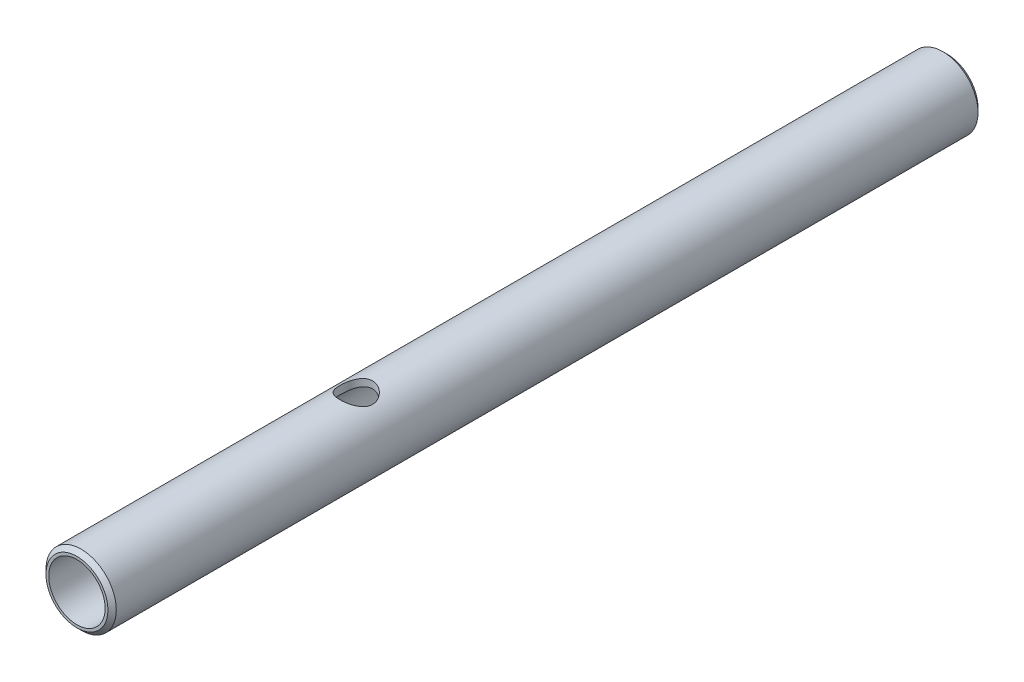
ISO-10303-21;
HEADER;
FILE_DESCRIPTION(('STEP AP214'),'2;1');
FILE_NAME('part.step','',(''),(''),'','','');
FILE_SCHEMA(('AUTOMOTIVE_DESIGN { 1 0 10303 214 1 1 1 1 }'));
ENDSEC;
DATA;
#1=APPLICATION_CONTEXT('core data for automotive mechanical design processes');
#2=APPLICATION_PROTOCOL_DEFINITION('international standard','automotive_design',2000,#1);
#3=PRODUCT_CONTEXT('',#1,'mechanical');
#4=PRODUCT('Part','Part','',(#3));
#5=PRODUCT_RELATED_PRODUCT_CATEGORY('part','',(#4));
#6=PRODUCT_DEFINITION_FORMATION('','',#4);
#7=PRODUCT_DEFINITION_CONTEXT('part definition',#1,'design');
#8=PRODUCT_DEFINITION('design','',#6,#7);
#9=PRODUCT_DEFINITION_SHAPE('','',#8);
#10=(LENGTH_UNIT() NAMED_UNIT(*) SI_UNIT(.MILLI.,.METRE.));
#11=(NAMED_UNIT(*) PLANE_ANGLE_UNIT() SI_UNIT($,.RADIAN.));
#12=(NAMED_UNIT(*) SI_UNIT($,.STERADIAN.) SOLID_ANGLE_UNIT());
#13=UNCERTAINTY_MEASURE_WITH_UNIT(LENGTH_MEASURE(1.E-05),#10,'distance_accuracy_value','');
#14=(GEOMETRIC_REPRESENTATION_CONTEXT(3) GLOBAL_UNCERTAINTY_ASSIGNED_CONTEXT((#13)) GLOBAL_UNIT_ASSIGNED_CONTEXT((#10,
#11,#12)) REPRESENTATION_CONTEXT('',''));
#15=CARTESIAN_POINT('',(0.,0.,0.));
#16=DIRECTION('',(0.,0.,1.));
#17=DIRECTION('',(1.,0.,0.));
#18=AXIS2_PLACEMENT_3D('',#15,#16,#17);
#19=CARTESIAN_POINT('',(0.,0.,302.207660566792));
#20=DIRECTION('',(0.,0.,-1.));
#21=DIRECTION('',(-1.,0.,0.));
#22=AXIS2_PLACEMENT_3D('',#19,#20,#21);
#23=CYLINDRICAL_SURFACE('',#22,10.668);
#24=CARTESIAN_POINT('',(0.,0.,1.26999999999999));
#25=DIRECTION('',(0.,0.,1.));
#26=DIRECTION('',(1.,0.,0.));
#27=AXIS2_PLACEMENT_3D('',#24,#25,#26);
#28=CIRCLE('',#27,10.668);
#29=CARTESIAN_POINT('',(10.668,0.,1.26999999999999));
#30=VERTEX_POINT('',#29);
#31=EDGE_CURVE('E49',#30,#30,#28,.T.);
#32=ORIENTED_EDGE('',*,*,#31,.T.);
#33=EDGE_LOOP('',(#32));
#34=FACE_BOUND('',#33,.T.);
#35=CARTESIAN_POINT('',(0.,0.,262.636));
#36=DIRECTION('',(0.,0.,1.));
#37=DIRECTION('',(1.,0.,0.));
#38=AXIS2_PLACEMENT_3D('',#35,#36,#37);
#39=CIRCLE('',#38,10.668);
#40=CARTESIAN_POINT('',(10.668,0.,262.636));
#41=VERTEX_POINT('',#40);
#42=EDGE_CURVE('E54',#41,#41,#39,.F.);
#43=ORIENTED_EDGE('',*,*,#42,.T.);
#44=EDGE_LOOP('',(#43));
#45=FACE_BOUND('',#44,.T.);
#46=CARTESIAN_POINT('',(0.,10.668,174.239111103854));
#47=CARTESIAN_POINT('',(-0.131525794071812,10.6679992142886,174.239112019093));
#48=CARTESIAN_POINT('',(-0.263076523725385,10.6655614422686,174.244348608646));
#49=CARTESIAN_POINT('',(-0.52522304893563,10.6558709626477,174.265240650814));
#50=CARTESIAN_POINT('',(-0.655818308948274,10.6486157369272,174.280901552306));
#51=CARTESIAN_POINT('',(-0.915247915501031,10.6294632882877,174.322502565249));
#52=CARTESIAN_POINT('',(-1.04407884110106,10.6175580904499,174.348460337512));
#53=CARTESIAN_POINT('',(-1.29887686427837,10.5894090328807,174.410381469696));
#54=CARTESIAN_POINT('',(-1.42484276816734,10.5731633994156,174.446348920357));
#55=CARTESIAN_POINT('',(-1.67251559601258,10.5368168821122,174.527755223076));
#56=CARTESIAN_POINT('',(-1.79423799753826,10.5167322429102,174.573154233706));
#57=CARTESIAN_POINT('',(-2.03325393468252,10.4731510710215,174.673094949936));
#58=CARTESIAN_POINT('',(-2.15054578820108,10.4496532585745,174.727640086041));
#59=CARTESIAN_POINT('',(-2.49462750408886,10.3748716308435,174.90427720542));
#60=CARTESIAN_POINT('',(-2.71392105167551,10.3192539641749,175.039469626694));
#61=CARTESIAN_POINT('',(-3.13903716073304,10.1982490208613,175.349119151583));
#62=CARTESIAN_POINT('',(-3.34347722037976,10.1324947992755,175.525312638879));
#63=CARTESIAN_POINT('',(-3.72124928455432,9.99993017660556,175.908473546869));
#64=CARTESIAN_POINT('',(-3.89456095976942,9.93311911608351,176.115460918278));
#65=CARTESIAN_POINT('',(-4.13313949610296,9.83521502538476,176.452808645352));
#66=CARTESIAN_POINT('',(-4.2110625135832,9.80201411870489,176.573804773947));
#67=CARTESIAN_POINT('',(-4.35635781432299,9.73830842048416,176.822627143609));
#68=CARTESIAN_POINT('',(-4.42373453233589,9.70780249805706,176.95045048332));
#69=CARTESIAN_POINT('',(-4.54734281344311,9.65052044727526,177.212176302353));
#70=CARTESIAN_POINT('',(-4.60357463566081,9.62374423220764,177.346078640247));
#71=CARTESIAN_POINT('',(-4.70427323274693,9.57492405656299,177.619002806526));
#72=CARTESIAN_POINT('',(-4.74874655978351,9.55287746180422,177.75802173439));
#73=CARTESIAN_POINT('',(-4.82329219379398,9.51544641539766,178.03239045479));
#74=CARTESIAN_POINT('',(-4.85402305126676,9.49976177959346,178.167520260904));
#75=CARTESIAN_POINT('',(-4.90411008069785,9.47400257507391,178.440339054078));
#76=CARTESIAN_POINT('',(-4.9234719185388,9.46392521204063,178.578026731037));
#77=CARTESIAN_POINT('',(-4.9505648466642,9.44978129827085,178.854791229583));
#78=CARTESIAN_POINT('',(-4.95830093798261,9.44571216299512,178.993867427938));
#79=CARTESIAN_POINT('',(-4.96204246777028,9.44374740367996,179.272216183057));
#80=CARTESIAN_POINT('',(-4.95804877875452,9.44585132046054,179.411488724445));
#81=CARTESIAN_POINT('',(-4.93938118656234,9.45562425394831,179.67505167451));
#82=CARTESIAN_POINT('',(-4.92581818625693,9.46271418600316,179.799444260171));
#83=CARTESIAN_POINT('',(-4.88940346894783,9.48158099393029,180.046540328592));
#84=CARTESIAN_POINT('',(-4.86654877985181,9.49335936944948,180.169243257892));
#85=CARTESIAN_POINT('',(-4.81179972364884,9.52122624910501,180.412092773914));
#86=CARTESIAN_POINT('',(-4.7799069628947,9.53731398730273,180.532239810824));
#87=CARTESIAN_POINT('',(-4.70739727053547,9.57331013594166,180.769301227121));
#88=CARTESIAN_POINT('',(-4.66677694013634,9.5932200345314,180.886214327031));
#89=CARTESIAN_POINT('',(-4.53030296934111,9.65882811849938,181.236316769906));
#90=CARTESIAN_POINT('',(-4.42105943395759,9.70974869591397,181.463470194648));
#91=CARTESIAN_POINT('',(-4.17069597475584,9.81988609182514,181.89711509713));
#92=CARTESIAN_POINT('',(-4.02956215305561,9.87910652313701,182.103597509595));
#93=CARTESIAN_POINT('',(-3.70164512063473,10.0069099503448,182.513593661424));
#94=CARTESIAN_POINT('',(-3.51158235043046,10.0758143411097,182.714392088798));
#95=CARTESIAN_POINT('',(-3.09985101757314,10.2099896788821,183.082363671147));
#96=CARTESIAN_POINT('',(-2.87817109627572,10.2752593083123,183.249524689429));
#97=CARTESIAN_POINT('',(-2.52161198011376,10.3664634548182,183.47406777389));
#98=CARTESIAN_POINT('',(-2.39637237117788,10.3961982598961,183.545537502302));
#99=CARTESIAN_POINT('',(-2.13952199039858,10.4520764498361,183.677567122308));
#100=CARTESIAN_POINT('',(-2.00791389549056,10.4782213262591,183.738131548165));
#101=CARTESIAN_POINT('',(-1.73926283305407,10.5261487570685,183.847715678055));
#102=CARTESIAN_POINT('',(-1.60222167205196,10.5479327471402,183.896739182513));
#103=CARTESIAN_POINT('',(-1.32371225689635,10.5864895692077,183.982697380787));
#104=CARTESIAN_POINT('',(-1.18224443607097,10.6032628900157,184.019633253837));
#105=CARTESIAN_POINT('',(-0.90678938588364,10.630223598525,184.078646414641));
#106=CARTESIAN_POINT('',(-0.773034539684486,10.6408098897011,184.101628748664));
#107=CARTESIAN_POINT('',(-0.503794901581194,10.6569506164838,184.136568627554));
#108=CARTESIAN_POINT('',(-0.368310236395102,10.6625054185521,184.14852697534));
#109=CARTESIAN_POINT('',(-0.0967464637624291,10.6684256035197,184.161269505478));
#110=CARTESIAN_POINT('',(0.0393324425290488,10.6687926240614,184.1620572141));
#111=CARTESIAN_POINT('',(0.311007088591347,10.6643308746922,184.152457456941));
#112=CARTESIAN_POINT('',(0.446602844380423,10.6595022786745,184.14207036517));
#113=CARTESIAN_POINT('',(0.707414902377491,10.645267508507,184.111290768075));
#114=CARTESIAN_POINT('',(0.832731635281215,10.6361802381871,184.091594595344));
#115=CARTESIAN_POINT('',(1.08116702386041,10.6138053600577,184.042753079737));
#116=CARTESIAN_POINT('',(1.20428496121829,10.600516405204,184.013604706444));
#117=CARTESIAN_POINT('',(1.44745745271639,10.5700565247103,183.946153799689));
#118=CARTESIAN_POINT('',(1.56751290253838,10.5528867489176,183.907853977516));
#119=CARTESIAN_POINT('',(1.80390035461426,10.5150620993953,183.822448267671));
#120=CARTESIAN_POINT('',(1.92023091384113,10.4944058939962,183.775339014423));
#121=CARTESIAN_POINT('',(2.26955792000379,10.4265301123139,183.618241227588));
#122=CARTESIAN_POINT('',(2.49559305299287,10.3743518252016,183.494509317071));
#123=CARTESIAN_POINT('',(2.92437804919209,10.2617526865,183.214881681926));
#124=CARTESIAN_POINT('',(3.12711761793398,10.2013282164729,183.058971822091));
#125=CARTESIAN_POINT('',(3.52239327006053,10.0720335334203,182.703608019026));
#126=CARTESIAN_POINT('',(3.71249446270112,10.0028864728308,182.501541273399));
#127=CARTESIAN_POINT('',(4.05706799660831,9.86816773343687,182.067596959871));
#128=CARTESIAN_POINT('',(4.21152367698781,9.80259773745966,181.835705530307));
#129=CARTESIAN_POINT('',(4.4152582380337,9.71171954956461,181.46556301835));
#130=CARTESIAN_POINT('',(4.47928245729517,9.68227332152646,181.336247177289));
#131=CARTESIAN_POINT('',(4.59606935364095,9.62738450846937,181.071829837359));
#132=CARTESIAN_POINT('',(4.64883707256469,9.60194013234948,180.936730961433));
#133=CARTESIAN_POINT('',(4.74250007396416,9.55602642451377,180.661760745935));
#134=CARTESIAN_POINT('',(4.7834033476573,9.53555374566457,180.521892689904));
#135=CARTESIAN_POINT('',(4.85285311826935,9.50039795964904,180.238409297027));
#136=CARTESIAN_POINT('',(4.8814011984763,9.48571411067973,180.094794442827));
#137=CARTESIAN_POINT('',(4.92373259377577,9.46380442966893,179.81811636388));
#138=CARTESIAN_POINT('',(4.93861146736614,9.45602733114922,179.685263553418));
#139=CARTESIAN_POINT('',(4.95759204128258,9.44609033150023,179.418584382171));
#140=CARTESIAN_POINT('',(4.96169457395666,9.44392999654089,179.284758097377));
#141=CARTESIAN_POINT('',(4.95906701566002,9.44530994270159,179.017274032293));
#142=CARTESIAN_POINT('',(4.95233942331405,9.44884890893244,178.883616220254));
#143=CARTESIAN_POINT('',(4.92814953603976,9.46148778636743,178.61754700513));
#144=CARTESIAN_POINT('',(4.9106874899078,9.47058756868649,178.48513557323));
#145=CARTESIAN_POINT('',(4.86689735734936,9.49316033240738,178.23208692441));
#146=CARTESIAN_POINT('',(4.84130059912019,9.50627004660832,178.111289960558));
#147=CARTESIAN_POINT('',(4.78133269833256,9.53657176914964,177.872404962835));
#148=CARTESIAN_POINT('',(4.74695878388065,9.55376506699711,177.754317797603));
#149=CARTESIAN_POINT('',(4.63113628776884,9.61073703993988,177.405196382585));
#150=CARTESIAN_POINT('',(4.53695752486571,9.65592382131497,177.179134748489));
#151=CARTESIAN_POINT('',(4.31034895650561,9.75927937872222,176.730734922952));
#152=CARTESIAN_POINT('',(4.17580188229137,9.81810893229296,176.509631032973));
#153=CARTESIAN_POINT('',(3.87488230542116,9.94072150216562,176.091772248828));
#154=CARTESIAN_POINT('',(3.70849505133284,10.0045068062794,175.895028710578));
#155=CARTESIAN_POINT('',(3.32897005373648,10.1374719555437,175.511171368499));
#156=CARTESIAN_POINT('',(3.11282993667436,10.2065581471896,175.32695630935));
#157=CARTESIAN_POINT('',(2.76636079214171,10.3037846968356,175.079630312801));
#158=CARTESIAN_POINT('',(2.64705387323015,10.33514959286,175.001969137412));
#159=CARTESIAN_POINT('',(2.40166723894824,10.3949085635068,174.856918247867));
#160=CARTESIAN_POINT('',(2.27559068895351,10.4233040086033,174.789523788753));
#161=CARTESIAN_POINT('',(2.01812521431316,10.4761912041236,174.665945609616));
#162=CARTESIAN_POINT('',(1.88676790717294,10.5007028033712,174.609704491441));
#163=CARTESIAN_POINT('',(1.61908071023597,10.5452925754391,174.508592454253));
#164=CARTESIAN_POINT('',(1.48275327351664,10.565372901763,174.463716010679));
#165=CARTESIAN_POINT('',(1.2064420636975,10.6004751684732,174.385917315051));
#166=CARTESIAN_POINT('',(1.06646759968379,10.6155088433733,174.35296731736));
#167=CARTESIAN_POINT('',(0.783788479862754,10.6401127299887,174.299312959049));
#168=CARTESIAN_POINT('',(0.641085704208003,10.6496865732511,174.278600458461));
#169=CARTESIAN_POINT('',(0.415044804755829,10.6602446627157,174.255806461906));
#170=CARTESIAN_POINT('',(0.332192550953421,10.6631497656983,174.249548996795));
#171=CARTESIAN_POINT('',(0.166230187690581,10.6670277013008,174.241200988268));
#172=CARTESIAN_POINT('',(0.0831200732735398,10.6680004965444,174.239110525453));
#173=CARTESIAN_POINT('',(0.,10.668,174.239111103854));
#174=B_SPLINE_CURVE_WITH_KNOTS('',3,(#46,#47,#48,#49,#50,#51,#52,#53,#54,#55,#56,#57,#58,#59,
#60,#61,#62,#63,#64,#65,#66,#67,#68,#69,#70,#71,#72,#73,#74,#75,#76,#77,#78,#79,#80,#81,#82,#83,
#84,#85,#86,#87,#88,#89,#90,#91,#92,#93,#94,#95,#96,#97,#98,#99,#100,#101,#102,#103,#104,#105,
#106,#107,#108,#109,#110,#111,#112,#113,#114,#115,#116,#117,#118,#119,#120,#121,#122,#123,#124,
#125,#126,#127,#128,#129,#130,#131,#132,#133,#134,#135,#136,#137,#138,#139,#140,#141,#142,#143,
#144,#145,#146,#147,#148,#149,#150,#151,#152,#153,#154,#155,#156,#157,#158,#159,#160,#161,#162,
#163,#164,#165,#166,#167,#168,#169,#170,#171,#172,#173),.UNSPECIFIED.,.T.,.F.,(4,2,2,2,2,2,2,2,
2,2,2,2,2,2,2,2,2,2,2,2,2,2,2,2,2,2,2,2,2,2,2,2,2,2,2,2,2,2,2,2,2,2,2,2,2,2,2,2,2,2,2,2,2,2,2,2,
2,2,2,2,2,2,2,4),(0.,0.394494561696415,0.78919549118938,1.18457634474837,1.58011901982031,
1.97402360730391,2.36807627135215,3.15524220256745,3.98524496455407,4.81578782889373,
5.25841469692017,5.70085493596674,6.14328488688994,6.58546778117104,7.00328287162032,
7.42088956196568,7.83831655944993,8.25571250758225,8.63126180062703,9.00693131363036,
9.38253410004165,9.7582834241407,10.5263165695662,11.2946850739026,12.1458155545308,
12.9972525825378,13.4384582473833,13.8794800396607,14.3203563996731,14.7611897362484,
15.1690354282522,15.5768514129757,15.984538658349,16.3922122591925,16.7733118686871,
17.1545337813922,17.5356428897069,17.9168978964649,18.7020429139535,19.4875335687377,
20.3415801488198,21.1960251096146,21.6373422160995,22.0784612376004,22.5192824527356,
22.9600471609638,23.3612359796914,23.7623938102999,24.1634591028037,24.5645151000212,
24.9366087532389,25.3088200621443,26.0527361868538,26.8458355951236,27.6393033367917,
28.5116035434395,28.948473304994,29.3851405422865,29.8194986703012,30.2536452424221,
30.6867752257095,31.1196167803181,31.3689198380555,31.6182277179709),.UNSPECIFIED.);
#175=CARTESIAN_POINT('',(0.,10.668,174.239111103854));
#176=VERTEX_POINT('',#175);
#177=EDGE_CURVE('E61',#176,#176,#174,.T.);
#178=ORIENTED_EDGE('',*,*,#177,.F.);
#179=EDGE_LOOP('',(#178));
#180=FACE_BOUND('',#179,.T.);
#181=ADVANCED_FACE('F33',(#34,#45,#180),#23,.T.);
#182=CARTESIAN_POINT('',(0.,0.,302.207660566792));
#183=DIRECTION('',(0.,0.,-1.));
#184=DIRECTION('',(-1.,0.,0.));
#185=AXIS2_PLACEMENT_3D('',#182,#183,#184);
#186=CYLINDRICAL_SURFACE('',#185,8.5598);
#187=CARTESIAN_POINT('',(0.,0.,263.906));
#188=DIRECTION('',(0.,0.,1.));
#189=DIRECTION('',(1.,0.,0.));
#190=AXIS2_PLACEMENT_3D('',#187,#188,#189);
#191=CIRCLE('',#190,8.5598);
#192=CARTESIAN_POINT('',(8.5598,0.,263.906));
#193=VERTEX_POINT('',#192);
#194=EDGE_CURVE('E58',#193,#193,#191,.T.);
#195=ORIENTED_EDGE('',*,*,#194,.T.);
#196=EDGE_LOOP('',(#195));
#197=FACE_BOUND('',#196,.T.);
#198=CARTESIAN_POINT('',(0.,0.,0.));
#199=DIRECTION('',(0.,0.,1.));
#200=DIRECTION('',(1.,0.,0.));
#201=AXIS2_PLACEMENT_3D('',#198,#199,#200);
#202=CIRCLE('',#201,8.5598);
#203=CARTESIAN_POINT('',(8.5598,0.,0.));
#204=VERTEX_POINT('',#203);
#205=EDGE_CURVE('E57',#204,#204,#202,.T.);
#206=ORIENTED_EDGE('',*,*,#205,.F.);
#207=EDGE_LOOP('',(#206));
#208=FACE_BOUND('',#207,.T.);
#209=CARTESIAN_POINT('',(0.,8.5598,174.239111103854));
#210=CARTESIAN_POINT('',(-0.127684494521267,8.55979898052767,174.239112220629));
#211=CARTESIAN_POINT('',(-0.255399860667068,8.55693576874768,174.24404841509));
#212=CARTESIAN_POINT('',(-0.509872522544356,8.54555125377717,174.2637323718));
#213=CARTESIAN_POINT('',(-0.636629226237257,8.53702670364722,174.278485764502));
#214=CARTESIAN_POINT('',(-0.888390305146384,8.51451339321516,174.317644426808));
#215=CARTESIAN_POINT('',(-1.01339103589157,8.50051462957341,174.342067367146));
#216=CARTESIAN_POINT('',(-1.26055009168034,8.46739319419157,174.400263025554));
#217=CARTESIAN_POINT('',(-1.38270718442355,8.44826834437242,174.434039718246));
#218=CARTESIAN_POINT('',(-1.62270939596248,8.40546049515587,174.510345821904));
#219=CARTESIAN_POINT('',(-1.7405737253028,8.3818018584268,174.552828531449));
#220=CARTESIAN_POINT('',(-1.97201273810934,8.33039147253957,174.646214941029));
#221=CARTESIAN_POINT('',(-2.08558577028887,8.30263816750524,174.697121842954));
#222=CARTESIAN_POINT('',(-2.41882433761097,8.21414225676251,174.861722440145));
#223=CARTESIAN_POINT('',(-2.63130797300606,8.14810814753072,174.987392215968));
#224=CARTESIAN_POINT('',(-3.04808770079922,8.00198250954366,175.277218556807));
#225=CARTESIAN_POINT('',(-3.25063591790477,7.92121469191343,175.443524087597));
#226=CARTESIAN_POINT('',(-3.62669242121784,7.756255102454,175.805178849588));
#227=CARTESIAN_POINT('',(-3.80016548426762,7.67205932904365,176.000562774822));
#228=CARTESIAN_POINT('',(-4.13285500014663,7.49857950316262,176.440790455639));
#229=CARTESIAN_POINT('',(-4.28826948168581,7.40978929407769,176.688725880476));
#230=CARTESIAN_POINT('',(-4.55457627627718,7.24915959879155,177.212394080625));
#231=CARTESIAN_POINT('',(-4.66553738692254,7.17729399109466,177.488083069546));
#232=CARTESIAN_POINT('',(-4.81775575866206,7.07571922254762,177.995433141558));
#233=CARTESIAN_POINT('',(-4.86911736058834,7.04014406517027,178.222885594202));
#234=CARTESIAN_POINT('',(-4.939357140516,6.99105445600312,178.684989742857));
#235=CARTESIAN_POINT('',(-4.95827165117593,6.9775153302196,178.919633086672));
#236=CARTESIAN_POINT('',(-4.96255931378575,6.97446722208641,179.389738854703));
#237=CARTESIAN_POINT('',(-4.94788149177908,6.98499475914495,179.625201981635));
#238=CARTESIAN_POINT('',(-4.88576917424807,7.02857076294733,180.089675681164));
#239=CARTESIAN_POINT('',(-4.83831153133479,7.06163514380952,180.318681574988));
#240=CARTESIAN_POINT('',(-4.71342878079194,7.14558000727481,180.763179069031));
#241=CARTESIAN_POINT('',(-4.63619128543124,7.19634876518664,180.978745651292));
#242=CARTESIAN_POINT('',(-4.45446232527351,7.31022633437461,181.39450821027));
#243=CARTESIAN_POINT('',(-4.34996055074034,7.37333981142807,181.594698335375));
#244=CARTESIAN_POINT('',(-4.09685628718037,7.51734426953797,182.008960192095));
#245=CARTESIAN_POINT('',(-3.94382763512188,7.5994519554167,182.219901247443));
#246=CARTESIAN_POINT('',(-3.6068532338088,7.76505007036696,182.615259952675));
#247=CARTESIAN_POINT('',(-3.42288017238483,7.84854166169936,182.799653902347));
#248=CARTESIAN_POINT('',(-3.11399776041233,7.97418386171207,183.063941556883));
#249=CARTESIAN_POINT('',(-2.99861489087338,8.01839258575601,183.154174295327));
#250=CARTESIAN_POINT('',(-2.75957688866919,8.10376395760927,183.324534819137));
#251=CARTESIAN_POINT('',(-2.63592484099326,8.14492772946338,183.404666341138));
#252=CARTESIAN_POINT('',(-2.38100736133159,8.22306223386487,183.554082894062));
#253=CARTESIAN_POINT('',(-2.24974351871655,8.26003383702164,183.623370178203));
#254=CARTESIAN_POINT('',(-1.98039331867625,8.32871676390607,183.750329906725));
#255=CARTESIAN_POINT('',(-1.84230781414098,8.36042874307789,183.808003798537));
#256=CARTESIAN_POINT('',(-1.5698820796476,8.41567803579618,183.907469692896));
#257=CARTESIAN_POINT('',(-1.43592073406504,8.4396233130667,183.950072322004));
#258=CARTESIAN_POINT('',(-1.16397880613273,8.48140580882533,184.023914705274));
#259=CARTESIAN_POINT('',(-1.02599881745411,8.49924392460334,184.055156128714));
#260=CARTESIAN_POINT('',(-0.747302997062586,8.52826631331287,184.105781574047));
#261=CARTESIAN_POINT('',(-0.606589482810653,8.53945598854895,184.125175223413));
#262=CARTESIAN_POINT('',(-0.323643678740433,8.55485214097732,184.151820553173));
#263=CARTESIAN_POINT('',(-0.181411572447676,8.55905945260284,184.15907368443));
#264=CARTESIAN_POINT('',(0.0852736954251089,8.56027985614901,184.16117873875));
#265=CARTESIAN_POINT('',(0.209714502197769,8.55813072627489,184.157474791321));
#266=CARTESIAN_POINT('',(0.457796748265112,8.54845084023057,184.140746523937));
#267=CARTESIAN_POINT('',(0.581437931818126,8.54091844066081,184.127719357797));
#268=CARTESIAN_POINT('',(0.826929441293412,8.52065257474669,184.092511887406));
#269=CARTESIAN_POINT('',(0.948780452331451,8.50792115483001,184.070335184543));
#270=CARTESIAN_POINT('',(1.18992249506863,8.47756246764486,184.017106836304));
#271=CARTESIAN_POINT('',(1.30921252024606,8.45993331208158,183.986051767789));
#272=CARTESIAN_POINT('',(1.65868449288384,8.40083517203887,183.881075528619));
#273=CARTESIAN_POINT('',(1.88419244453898,8.35282875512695,183.794793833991));
#274=CARTESIAN_POINT('',(2.31749822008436,8.24314966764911,183.592259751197));
#275=CARTESIAN_POINT('',(2.52529199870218,8.18147388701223,183.476000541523));
#276=CARTESIAN_POINT('',(2.94080503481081,8.04205676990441,183.203158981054));
#277=CARTESIAN_POINT('',(3.14625676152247,7.96331078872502,183.04363591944));
#278=CARTESIAN_POINT('',(3.52905751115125,7.8012343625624,182.695525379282));
#279=CARTESIAN_POINT('',(3.70637349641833,7.71789868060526,182.50690423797));
#280=CARTESIAN_POINT('',(4.04908018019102,7.54427940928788,182.080034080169));
#281=CARTESIAN_POINT('',(4.21064949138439,7.45432342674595,181.838560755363));
#282=CARTESIAN_POINT('',(4.49065731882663,7.28908064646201,181.327269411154));
#283=CARTESIAN_POINT('',(4.60915048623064,7.21377531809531,181.057487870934));
#284=CARTESIAN_POINT('',(4.77726188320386,7.10322607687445,180.556056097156));
#285=CARTESIAN_POINT('',(4.83620961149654,7.06285049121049,180.328672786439));
#286=CARTESIAN_POINT('',(4.92140417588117,7.00376520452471,179.865218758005));
#287=CARTESIAN_POINT('',(4.94769056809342,6.98502929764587,179.629158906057));
#288=CARTESIAN_POINT('',(4.96611066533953,6.97194922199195,179.154423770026));
#289=CARTESIAN_POINT('',(4.95816041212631,6.97766501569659,178.915743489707));
#290=CARTESIAN_POINT('',(4.90841392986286,7.01273936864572,178.443663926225));
#291=CARTESIAN_POINT('',(4.86659672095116,7.0421125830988,178.210268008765));
#292=CARTESIAN_POINT('',(4.75285865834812,7.11934179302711,177.760797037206));
#293=CARTESIAN_POINT('',(4.68172875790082,7.16670978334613,177.544432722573));
#294=CARTESIAN_POINT('',(4.51214995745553,7.27466474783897,177.126276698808));
#295=CARTESIAN_POINT('',(4.41369122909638,7.33525647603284,176.924490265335));
#296=CARTESIAN_POINT('',(4.17471086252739,7.47421485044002,176.507925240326));
#297=CARTESIAN_POINT('',(4.0300378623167,7.55388114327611,176.295968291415));
#298=CARTESIAN_POINT('',(3.71029050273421,7.71595909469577,175.897181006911));
#299=CARTESIAN_POINT('',(3.53518848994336,7.79837319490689,175.710373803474));
#300=CARTESIAN_POINT('',(3.23904513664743,7.92416585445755,175.439747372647));
#301=CARTESIAN_POINT('',(3.1272985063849,7.9690370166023,175.346282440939));
#302=CARTESIAN_POINT('',(2.8953839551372,8.05619309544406,175.16912629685));
#303=CARTESIAN_POINT('',(2.77521901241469,8.09847891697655,175.085431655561));
#304=CARTESIAN_POINT('',(2.52706260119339,8.17931312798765,174.928518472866));
#305=CARTESIAN_POINT('',(2.39907199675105,8.21786192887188,174.85529877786));
#306=CARTESIAN_POINT('',(2.13600124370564,8.29013052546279,174.720098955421));
#307=CARTESIAN_POINT('',(2.0009230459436,8.32385164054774,174.658115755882));
#308=CARTESIAN_POINT('',(1.74927695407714,8.37996044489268,174.556156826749));
#309=CARTESIAN_POINT('',(1.63370815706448,8.40329673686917,174.514227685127));
#310=CARTESIAN_POINT('',(1.39904419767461,8.44553459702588,174.438890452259));
#311=CARTESIAN_POINT('',(1.27994966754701,8.46443695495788,174.405480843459));
#312=CARTESIAN_POINT('',(1.03924316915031,8.49734505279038,174.347616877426));
#313=CARTESIAN_POINT('',(0.91763780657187,8.51136224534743,174.32314156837));
#314=CARTESIAN_POINT('',(0.672504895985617,8.53422810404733,174.28334104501));
#315=CARTESIAN_POINT('',(0.548978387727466,8.54307947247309,174.268011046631));
#316=CARTESIAN_POINT('',(0.354350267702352,8.552754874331,174.251275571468));
#317=CARTESIAN_POINT('',(0.283592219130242,8.55539439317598,174.246716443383));
#318=CARTESIAN_POINT('',(0.141892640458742,8.55891736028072,174.240633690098));
#319=CARTESIAN_POINT('',(0.0709510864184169,8.55980056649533,174.23911048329));
#320=CARTESIAN_POINT('',(0.,8.5598,174.239111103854));
#321=B_SPLINE_CURVE_WITH_KNOTS('',3,(#209,#210,#211,#212,#213,#214,#215,#216,#217,#218,#219,
#220,#221,#222,#223,#224,#225,#226,#227,#228,#229,#230,#231,#232,#233,#234,#235,#236,#237,#238,
#239,#240,#241,#242,#243,#244,#245,#246,#247,#248,#249,#250,#251,#252,#253,#254,#255,#256,#257,
#258,#259,#260,#261,#262,#263,#264,#265,#266,#267,#268,#269,#270,#271,#272,#273,#274,#275,#276,
#277,#278,#279,#280,#281,#282,#283,#284,#285,#286,#287,#288,#289,#290,#291,#292,#293,#294,#295,
#296,#297,#298,#299,#300,#301,#302,#303,#304,#305,#306,#307,#308,#309,#310,#311,#312,#313,#314,
#315,#316,#317,#318,#319,#320),.UNSPECIFIED.,.T.,.F.,(4,2,2,2,2,2,2,2,2,2,2,2,2,2,2,2,2,2,2,2,2,
2,2,2,2,2,2,2,2,2,2,2,2,2,2,2,2,2,2,2,2,2,2,2,2,2,2,2,2,2,2,2,2,2,2,4),(0.,0.382980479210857,
0.766180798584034,1.15008465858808,1.53415189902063,1.91621043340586,2.29841451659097,
3.06187762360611,3.88142042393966,4.7019489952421,5.61482681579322,6.52628632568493,
7.23087837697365,7.9346809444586,8.63955218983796,9.34492168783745,10.0459181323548,
10.7471800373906,11.5637591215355,12.3810627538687,12.839570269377,13.2979076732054,
13.7561497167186,14.2143346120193,14.641514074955,15.0686307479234,15.4953998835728,
15.9221180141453,16.2952016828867,16.6683992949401,17.0414501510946,17.4146450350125,
18.1498364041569,18.885195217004,19.6972396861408,20.5102307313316,21.4183242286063,
22.3252615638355,23.0372714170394,23.7484181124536,24.461309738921,25.1746433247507,
25.869872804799,26.5653526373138,27.3684563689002,28.1722938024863,28.6291159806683,
29.0857773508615,29.5423883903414,29.998874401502,30.3738885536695,30.7488358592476,
31.1228981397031,31.4967645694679,31.7095479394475,31.9223606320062),.UNSPECIFIED.);
#322=CARTESIAN_POINT('',(0.,8.5598,174.239111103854));
#323=VERTEX_POINT('',#322);
#324=EDGE_CURVE('E37',#323,#323,#321,.T.);
#325=ORIENTED_EDGE('',*,*,#324,.T.);
#326=EDGE_LOOP('',(#325));
#327=FACE_BOUND('',#326,.T.);
#328=ADVANCED_FACE('F80',(#197,#208,#327),#186,.F.);
#329=CARTESIAN_POINT('',(0.,0.,0.));
#330=DIRECTION('',(0.,0.,1.));
#331=DIRECTION('',(1.,0.,0.));
#332=AXIS2_PLACEMENT_3D('',#329,#330,#331);
#333=PLANE('',#332);
#334=CARTESIAN_POINT('',(0.,0.,0.));
#335=DIRECTION('',(0.,0.,1.));
#336=DIRECTION('',(1.,0.,0.));
#337=AXIS2_PLACEMENT_3D('',#334,#335,#336);
#338=CIRCLE('',#337,9.39799999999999);
#339=CARTESIAN_POINT('',(9.39799999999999,0.,0.));
#340=VERTEX_POINT('',#339);
#341=EDGE_CURVE('E45',#340,#340,#338,.F.);
#342=ORIENTED_EDGE('',*,*,#341,.T.);
#343=EDGE_LOOP('',(#342));
#344=FACE_BOUND('',#343,.T.);
#345=ORIENTED_EDGE('',*,*,#205,.T.);
#346=EDGE_LOOP('',(#345));
#347=FACE_BOUND('',#346,.T.);
#348=ADVANCED_FACE('F79',(#344,#347),#333,.F.);
#349=CARTESIAN_POINT('',(0.,24.13,263.906));
#350=DIRECTION('',(0.,0.,1.));
#351=DIRECTION('',(1.,0.,0.));
#352=AXIS2_PLACEMENT_3D('',#349,#350,#351);
#353=PLANE('',#352);
#354=CARTESIAN_POINT('',(0.,0.,263.906));
#355=DIRECTION('',(0.,0.,1.));
#356=DIRECTION('',(1.,0.,0.));
#357=AXIS2_PLACEMENT_3D('',#354,#355,#356);
#358=CIRCLE('',#357,9.39799999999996);
#359=CARTESIAN_POINT('',(9.39799999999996,0.,263.906));
#360=VERTEX_POINT('',#359);
#361=EDGE_CURVE('E11',#360,#360,#358,.T.);
#362=ORIENTED_EDGE('',*,*,#361,.T.);
#363=EDGE_LOOP('',(#362));
#364=FACE_BOUND('',#363,.T.);
#365=ORIENTED_EDGE('',*,*,#194,.F.);
#366=EDGE_LOOP('',(#365));
#367=FACE_BOUND('',#366,.T.);
#368=ADVANCED_FACE('F75',(#364,#367),#353,.T.);
#369=CARTESIAN_POINT('',(0.,0.,1.26999999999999));
#370=DIRECTION('',(0.,0.,1.));
#371=DIRECTION('',(1.,0.,0.));
#372=AXIS2_PLACEMENT_3D('',#369,#370,#371);
#373=CONICAL_SURFACE('',#372,10.668,0.785398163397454);
#374=ORIENTED_EDGE('',*,*,#341,.F.);
#375=EDGE_LOOP('',(#374));
#376=FACE_BOUND('',#375,.T.);
#377=ORIENTED_EDGE('',*,*,#31,.F.);
#378=EDGE_LOOP('',(#377));
#379=FACE_BOUND('',#378,.T.);
#380=ADVANCED_FACE('F78',(#376,#379),#373,.T.);
#381=CARTESIAN_POINT('',(0.,0.,263.906));
#382=DIRECTION('',(0.,0.,-1.));
#383=DIRECTION('',(-1.,0.,0.));
#384=AXIS2_PLACEMENT_3D('',#381,#382,#383);
#385=CONICAL_SURFACE('',#384,9.39799999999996,0.785398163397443);
#386=ORIENTED_EDGE('',*,*,#42,.F.);
#387=EDGE_LOOP('',(#386));
#388=FACE_BOUND('',#387,.T.);
#389=ORIENTED_EDGE('',*,*,#361,.F.);
#390=EDGE_LOOP('',(#389));
#391=FACE_BOUND('',#390,.T.);
#392=ADVANCED_FACE('F35',(#388,#391),#385,.T.);
#393=CARTESIAN_POINT('',(0.,10.668,179.199731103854));
#394=DIRECTION('',(0.,-1.,0.));
#395=DIRECTION('',(0.,0.,-1.));
#396=AXIS2_PLACEMENT_3D('',#393,#394,#395);
#397=CYLINDRICAL_SURFACE('',#396,4.96061999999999);
#398=ORIENTED_EDGE('',*,*,#324,.F.);
#399=EDGE_LOOP('',(#398));
#400=FACE_BOUND('',#399,.T.);
#401=ORIENTED_EDGE('',*,*,#177,.T.);
#402=EDGE_LOOP('',(#401));
#403=FACE_BOUND('',#402,.T.);
#404=ADVANCED_FACE('F70',(#400,#403),#397,.F.);
#405=CLOSED_SHELL('',(#181,#328,#348,#368,#380,#392,#404));
#406=MANIFOLD_SOLID_BREP('B2',#405);
#407=ADVANCED_BREP_SHAPE_REPRESENTATION('',(#18,#406),#14);
#408=SHAPE_DEFINITION_REPRESENTATION(#9,#407);
ENDSEC;
END-ISO-10303-21;
